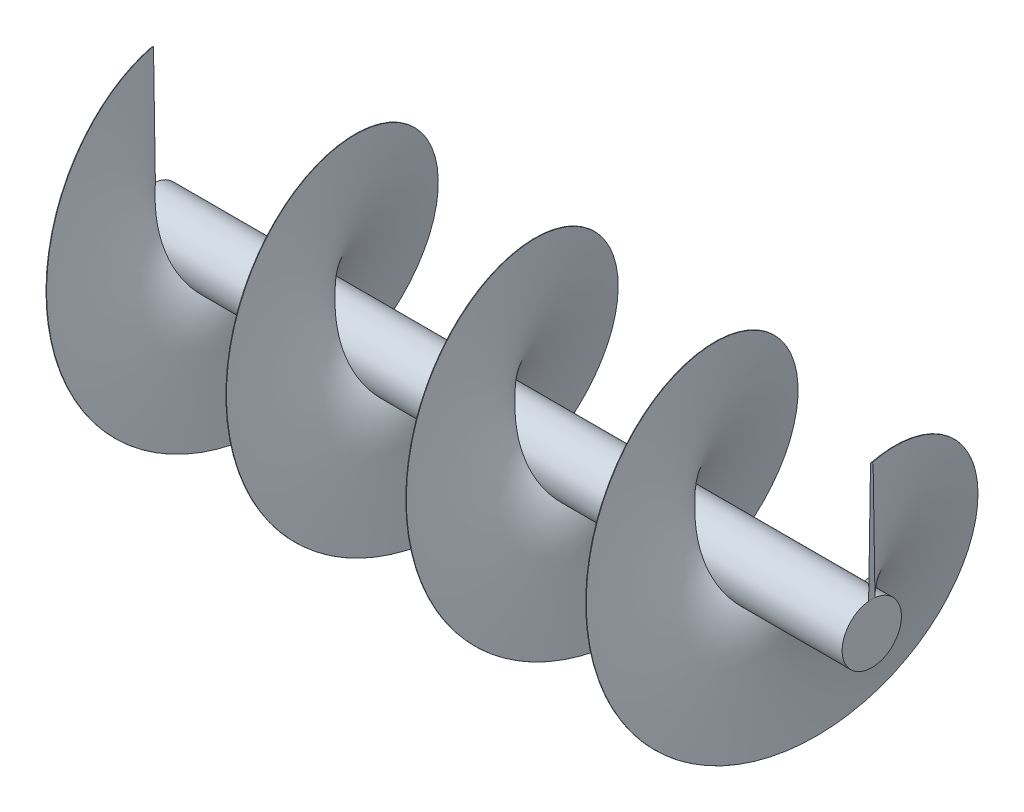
from build123d import *

# Parameters (mm, degrees)
SKETCH1_R                = 10
BOSS_EXTRUDE1_DEPTH      = 410
BOSS_EXTRUDE2_START      = 450
SKETCH1_3_R              = 10
BOSS_EXTRUDE2_DEPTH      = 450
BOSS_EXTRUDE3_DEPTH      = 450
BOSS_EXTRUDE3_DEPTH_BACK = 400
SKETCH1_4_R              = 35
SKETCH1_4_R_2            = 25
BOSS_EXTRUDE4_START      = 450
SKETCH1_5_R              = 25
SKETCH1_5_R_2            = 10
BOSS_EXTRUDE4_DEPTH      = 10
BOSS_EXTRUDE5_START      = -400
SKETCH1_6_R              = 25
SKETCH1_6_R_2            = 10
BOSS_EXTRUDE5_DEPTH      = 10
SWEEP1_PITCH             = 212.5
SWEEP1_HEIGHT            = 850
SWEEP1_RADIUS            = 175
SWEEP1_START_ANGLE       = -90


with BuildPart() as part:
    # Sketch1 → Boss-Extrude1 (new body)
    with BuildSketch(Plane(origin=(0, 0, 0), x_dir=(0, 0, -1), z_dir=(1, 0, 0))):
        Circle(SKETCH1_R)
    extrude(amount=-BOSS_EXTRUDE1_DEPTH)

    # Sketch1_3 → Boss-Extrude2 (add)
    with BuildSketch(Plane(origin=(0, 0, 0), x_dir=(0, 0, -1), z_dir=(1, 0, 0)).offset(BOSS_EXTRUDE2_START)):
        Circle(SKETCH1_3_R)
    extrude(amount=-BOSS_EXTRUDE2_DEPTH)



with BuildPart() as body_2:
    # Sketch1_4 → Boss-Extrude3 (new, two sides: drawn at the far end of the back side and taken through both)
    with BuildSketch(Plane(origin=(0, 0, 0), x_dir=(0, 0, -1), z_dir=(1, 0, 0)).offset(-BOSS_EXTRUDE3_DEPTH_BACK)):
        Circle(SKETCH1_4_R)
        Circle(SKETCH1_4_R_2, mode=Mode.SUBTRACT)
    extrude(amount=BOSS_EXTRUDE3_DEPTH + BOSS_EXTRUDE3_DEPTH_BACK)


with BuildPart() as part_1:
    add(part.part)

    add(body_2.part)  # Boss-Extrude4 merges body 2
    # Sketch1_5 → Boss-Extrude4 (add)
    with BuildSketch(Plane(origin=(0, 0, 0), x_dir=(0, 0, -1), z_dir=(1, 0, 0)).offset(BOSS_EXTRUDE4_START)):
        Circle(SKETCH1_5_R)
        Circle(SKETCH1_5_R_2, mode=Mode.SUBTRACT)
    extrude(amount=-BOSS_EXTRUDE4_DEPTH)

    # Sketch1_6 → Boss-Extrude5 (add)
    with BuildSketch(Plane(origin=(0, 0, 0), x_dir=(0, 0, -1), z_dir=(1, 0, 0)).offset(BOSS_EXTRUDE5_START)):
        Circle(SKETCH1_6_R)
        Circle(SKETCH1_6_R_2, mode=Mode.SUBTRACT)
    extrude(amount=BOSS_EXTRUDE5_DEPTH)


with BuildPart() as body_2_2:
    # Sweep1: sweep along a helix
    with BuildLine() as sweep1_path:
        add(Helix(SWEEP1_PITCH, SWEEP1_HEIGHT, SWEEP1_RADIUS, center=(450, 0, 0), direction=(-1, 0, 0), mode=Mode.PRIVATE).rotate(Axis((450, 0, 0), (-1, 0, 0)), SWEEP1_START_ANGLE))
    # Sketch3 → Sweep1 (sweep)
    with BuildSketch(Plane(origin=(450, 0, 0), x_dir=(0, 0, -1), z_dir=(1, 0, 0))):
        with BuildLine():
            Line((-1.527143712, 174.993336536), (-3.75, 34.798527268))
            ThreePointArc((-3.75, 34.798527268), (0, 35), (3.75, 34.798527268))
            Line((3.75, 34.798527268), (1.527143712, 174.993336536))
            ThreePointArc((1.527143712, 174.993336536), (0, 175), (-1.527143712, 174.993336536))
        make_face()
    sweep(path=sweep1_path.line, is_frenet=True)


solid = Compound([part_1.part, body_2_2.part])
